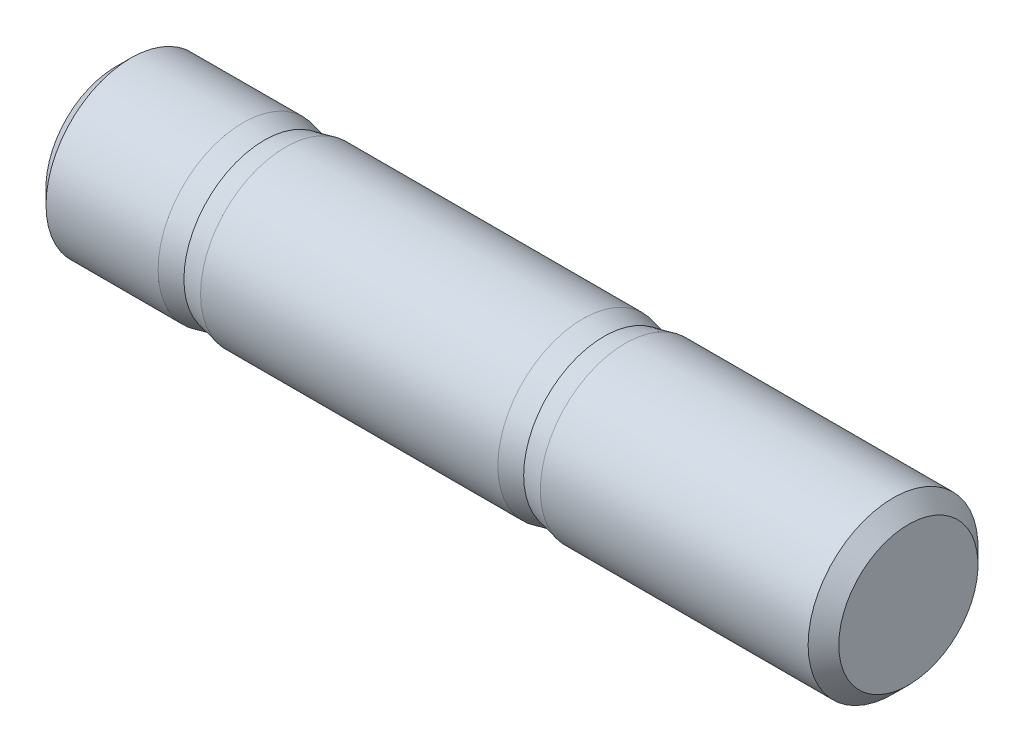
from build123d import *

# Parameters (mm, degrees)
HEADCHAMFER_SIZE = 0.5415


with BuildPart() as part:
    # Sketch1 → BaseHead (revolve)
    with BuildSketch(Plane.XY, mode=Mode.PRIVATE) as basehead_sk:
        Polygon((0, 0), (0, 3), (4.5, 3), (6, 2.675), (16.5, 2.675), (18, 3), (28, 3), (28, 0), align=None)
    revolve(basehead_sk.sketch.rotate(Axis((-1.310841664, 0, 0), (1, 0, 0)), 90), axis=Axis((-1.310841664, 0, 0), (1, 0, 0)))

    # HeadChamfer
    headchamfer_edges = [part.edges().sort_by_distance(p)[0] for p in [
        (28, 0, -3),
        (0, 0, -3),
    ]]
    chamfer(headchamfer_edges, length=HEADCHAMFER_SIZE)

    # Sketch2 → BaseBody (revolve)
    with BuildSketch(Plane.XY, mode=Mode.PRIVATE) as basebody_sk:
        Polygon((4.5, 2.675), (6, 3), (16.5, 3), (18, 2.675), align=None)
    revolve(basebody_sk.sketch.rotate(Axis((4.977430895, 0, 0), (1, 0, 0)), 90), axis=Axis((4.977430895, 0, 0), (1, 0, 0)))


solid = part.part
